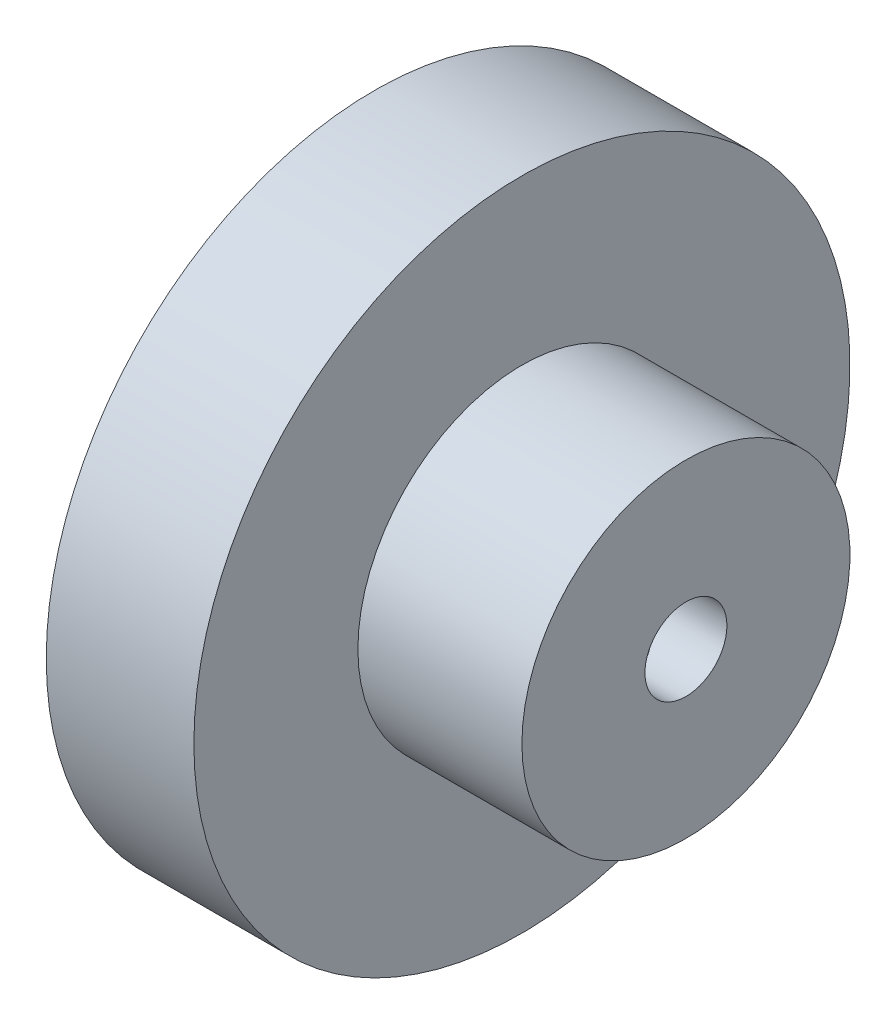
ISO-10303-21;
HEADER;
FILE_DESCRIPTION(('STEP AP214'),'2;1');
FILE_NAME('part.step','',(''),(''),'','','');
FILE_SCHEMA(('AUTOMOTIVE_DESIGN { 1 0 10303 214 1 1 1 1 }'));
ENDSEC;
DATA;
#1=APPLICATION_CONTEXT('core data for automotive mechanical design processes');
#2=APPLICATION_PROTOCOL_DEFINITION('international standard','automotive_design',2000,#1);
#3=PRODUCT_CONTEXT('',#1,'mechanical');
#4=PRODUCT('Part','Part','',(#3));
#5=PRODUCT_RELATED_PRODUCT_CATEGORY('part','',(#4));
#6=PRODUCT_DEFINITION_FORMATION('','',#4);
#7=PRODUCT_DEFINITION_CONTEXT('part definition',#1,'design');
#8=PRODUCT_DEFINITION('design','',#6,#7);
#9=PRODUCT_DEFINITION_SHAPE('','',#8);
#10=(LENGTH_UNIT() NAMED_UNIT(*) SI_UNIT(.MILLI.,.METRE.));
#11=(NAMED_UNIT(*) PLANE_ANGLE_UNIT() SI_UNIT($,.RADIAN.));
#12=(NAMED_UNIT(*) SI_UNIT($,.STERADIAN.) SOLID_ANGLE_UNIT());
#13=UNCERTAINTY_MEASURE_WITH_UNIT(LENGTH_MEASURE(1.E-05),#10,'distance_accuracy_value','');
#14=(GEOMETRIC_REPRESENTATION_CONTEXT(3) GLOBAL_UNCERTAINTY_ASSIGNED_CONTEXT((#13)) GLOBAL_UNIT_ASSIGNED_CONTEXT((#10,
#11,#12)) REPRESENTATION_CONTEXT('',''));
#15=CARTESIAN_POINT('',(0.,0.,0.));
#16=DIRECTION('',(0.,0.,1.));
#17=DIRECTION('',(1.,0.,0.));
#18=AXIS2_PLACEMENT_3D('',#15,#16,#17);
#19=CARTESIAN_POINT('',(0.,0.,-20.));
#20=DIRECTION('',(1.,0.,0.));
#21=DIRECTION('',(0.,0.,-1.));
#22=AXIS2_PLACEMENT_3D('',#19,#20,#21);
#23=PLANE('',#22);
#24=CARTESIAN_POINT('',(0.,0.,0.));
#25=DIRECTION('',(1.,0.,0.));
#26=DIRECTION('',(0.,0.,-1.));
#27=AXIS2_PLACEMENT_3D('',#24,#25,#26);
#28=CIRCLE('',#27,2.5);
#29=CARTESIAN_POINT('',(0.,0.,-2.5));
#30=VERTEX_POINT('',#29);
#31=EDGE_CURVE('E53',#30,#30,#28,.T.);
#32=ORIENTED_EDGE('',*,*,#31,.T.);
#33=EDGE_LOOP('',(#32));
#34=FACE_BOUND('',#33,.T.);
#35=CARTESIAN_POINT('',(0.,0.,0.));
#36=DIRECTION('',(-1.,0.,0.));
#37=DIRECTION('',(0.,0.,1.));
#38=AXIS2_PLACEMENT_3D('',#35,#36,#37);
#39=CIRCLE('',#38,20.);
#40=CARTESIAN_POINT('',(0.,0.,20.));
#41=VERTEX_POINT('',#40);
#42=EDGE_CURVE('E50',#41,#41,#39,.T.);
#43=ORIENTED_EDGE('',*,*,#42,.T.);
#44=EDGE_LOOP('',(#43));
#45=FACE_BOUND('',#44,.T.);
#46=ADVANCED_FACE('F30',(#34,#45),#23,.F.);
#47=CARTESIAN_POINT('',(19.,0.,0.));
#48=DIRECTION('',(-1.,0.,0.));
#49=DIRECTION('',(0.,0.,1.));
#50=AXIS2_PLACEMENT_3D('',#47,#48,#49);
#51=PLANE('',#50);
#52=CARTESIAN_POINT('',(19.,0.,0.));
#53=DIRECTION('',(1.,0.,0.));
#54=DIRECTION('',(0.,0.,-1.));
#55=AXIS2_PLACEMENT_3D('',#52,#53,#54);
#56=CIRCLE('',#55,2.5);
#57=CARTESIAN_POINT('',(19.,0.,-2.5));
#58=VERTEX_POINT('',#57);
#59=EDGE_CURVE('E56',#58,#58,#56,.T.);
#60=ORIENTED_EDGE('',*,*,#59,.F.);
#61=EDGE_LOOP('',(#60));
#62=FACE_BOUND('',#61,.T.);
#63=CARTESIAN_POINT('',(19.,0.,0.));
#64=DIRECTION('',(-1.,0.,0.));
#65=DIRECTION('',(0.,0.,1.));
#66=AXIS2_PLACEMENT_3D('',#63,#64,#65);
#67=CIRCLE('',#66,9.99999999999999);
#68=CARTESIAN_POINT('',(19.,0.,9.99999999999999));
#69=VERTEX_POINT('',#68);
#70=EDGE_CURVE('E10',#69,#69,#67,.T.);
#71=ORIENTED_EDGE('',*,*,#70,.F.);
#72=EDGE_LOOP('',(#71));
#73=FACE_BOUND('',#72,.T.);
#74=ADVANCED_FACE('F86',(#62,#73),#51,.F.);
#75=CARTESIAN_POINT('',(0.,0.,0.));
#76=DIRECTION('',(-1.,0.,0.));
#77=DIRECTION('',(0.,0.,1.));
#78=AXIS2_PLACEMENT_3D('',#75,#76,#77);
#79=CYLINDRICAL_SURFACE('',#78,9.99999999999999);
#80=CARTESIAN_POINT('',(12.,-10.,0.));
#81=CARTESIAN_POINT('',(12.0000040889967,-9.99999795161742,0.111153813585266));
#82=CARTESIAN_POINT('',(12.0092976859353,-9.99812770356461,0.222359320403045));
#83=CARTESIAN_POINT('',(12.0461970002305,-9.99084731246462,0.441627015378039));
#84=CARTESIAN_POINT('',(12.073817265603,-9.98543435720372,0.549686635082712));
#85=CARTESIAN_POINT('',(12.1464825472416,-9.97167298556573,0.759460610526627));
#86=CARTESIAN_POINT('',(12.1915108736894,-9.96332738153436,0.86118093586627));
#87=CARTESIAN_POINT('',(12.2976644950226,-9.94460796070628,1.05561597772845));
#88=CARTESIAN_POINT('',(12.3587888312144,-9.93423426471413,1.14833123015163));
#89=CARTESIAN_POINT('',(12.4962769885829,-9.91244330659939,1.32338695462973));
#90=CARTESIAN_POINT('',(12.5728167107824,-9.90101491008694,1.40558790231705));
#91=CARTESIAN_POINT('',(12.7385848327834,-9.87848360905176,1.55607351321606));
#92=CARTESIAN_POINT('',(12.8278142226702,-9.86738073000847,1.62435708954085));
#93=CARTESIAN_POINT('',(13.0174323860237,-9.8466488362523,1.74566350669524));
#94=CARTESIAN_POINT('',(13.1179152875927,-9.83703414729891,1.79854187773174));
#95=CARTESIAN_POINT('',(13.3265636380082,-9.82052536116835,1.88661133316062));
#96=CARTESIAN_POINT('',(13.4347283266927,-9.81363099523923,1.92180416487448));
#97=CARTESIAN_POINT('',(13.6541687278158,-9.80345610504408,1.97305059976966));
#98=CARTESIAN_POINT('',(13.7653850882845,-9.80012940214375,1.98934899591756));
#99=CARTESIAN_POINT('',(13.9890196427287,-9.79732750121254,2.00310425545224));
#100=CARTESIAN_POINT('',(14.1014377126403,-9.79785190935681,2.000563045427));
#101=CARTESIAN_POINT('',(14.322493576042,-9.80265102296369,1.97690914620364));
#102=CARTESIAN_POINT('',(14.4311628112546,-9.80686905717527,1.95607708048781));
#103=CARTESIAN_POINT('',(14.643432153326,-9.81849092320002,1.8968757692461));
#104=CARTESIAN_POINT('',(14.747032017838,-9.82589490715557,1.85850568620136));
#105=CARTESIAN_POINT('',(14.9470305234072,-9.84311237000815,1.76504956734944));
#106=CARTESIAN_POINT('',(15.0433757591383,-9.85294179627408,1.70985230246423));
#107=CARTESIAN_POINT('',(15.2255416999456,-9.87389237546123,1.58438714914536));
#108=CARTESIAN_POINT('',(15.3113611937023,-9.88501367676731,1.51411752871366));
#109=CARTESIAN_POINT('',(15.4716588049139,-9.90754042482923,1.35899986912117));
#110=CARTESIAN_POINT('',(15.5459051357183,-9.91894738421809,1.27391232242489));
#111=CARTESIAN_POINT('',(15.6791076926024,-9.94057697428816,1.09237004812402));
#112=CARTESIAN_POINT('',(15.7380637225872,-9.95079958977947,0.995915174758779));
#113=CARTESIAN_POINT('',(15.8390550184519,-9.96893380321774,0.794118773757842));
#114=CARTESIAN_POINT('',(15.8810637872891,-9.97684177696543,0.688763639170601));
#115=CARTESIAN_POINT('',(15.9467209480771,-9.98942817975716,0.47229795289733));
#116=CARTESIAN_POINT('',(15.9703715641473,-9.99410700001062,0.361188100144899));
#117=CARTESIAN_POINT('',(15.9983129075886,-9.99965343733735,0.138358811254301));
#118=CARTESIAN_POINT('',(16.0029208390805,-10.0005834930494,0.0266806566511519));
#119=CARTESIAN_POINT('',(15.9935002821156,-9.99870103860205,-0.195849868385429));
#120=CARTESIAN_POINT('',(15.9794728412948,-9.99588873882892,-0.306702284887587));
#121=CARTESIAN_POINT('',(15.9334432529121,-9.98687664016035,-0.523411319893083));
#122=CARTESIAN_POINT('',(15.9016038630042,-9.98070752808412,-0.629303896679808));
#123=CARTESIAN_POINT('',(15.8210320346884,-9.96567104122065,-0.834247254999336));
#124=CARTESIAN_POINT('',(15.7722983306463,-9.95680346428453,-0.93329752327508));
#125=CARTESIAN_POINT('',(15.6586350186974,-9.93719823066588,-1.12308234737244));
#126=CARTESIAN_POINT('',(15.5935144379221,-9.92643900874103,-1.21370025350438));
#127=CARTESIAN_POINT('',(15.4491816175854,-9.90429469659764,-1.38283603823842));
#128=CARTESIAN_POINT('',(15.3699678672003,-9.89290953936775,-1.46135261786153));
#129=CARTESIAN_POINT('',(15.1982532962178,-9.87058607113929,-1.60528118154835));
#130=CARTESIAN_POINT('',(15.1055685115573,-9.85965720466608,-1.67047540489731));
#131=CARTESIAN_POINT('',(14.9103772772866,-9.83968383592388,-1.78437084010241));
#132=CARTESIAN_POINT('',(14.8078712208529,-9.83063925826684,-1.83307271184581));
#133=CARTESIAN_POINT('',(14.5964635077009,-9.81553481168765,-1.91230368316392));
#134=CARTESIAN_POINT('',(14.4875983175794,-9.80945949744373,-1.9429269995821));
#135=CARTESIAN_POINT('',(14.2661330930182,-9.8009487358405,-1.9854173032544));
#136=CARTESIAN_POINT('',(14.1535335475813,-9.79851281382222,-1.99728673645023));
#137=CARTESIAN_POINT('',(13.9299822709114,-9.79758299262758,-2.00184182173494));
#138=CARTESIAN_POINT('',(13.819037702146,-9.79901838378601,-1.99487157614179));
#139=CARTESIAN_POINT('',(13.5999367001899,-9.80551146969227,-1.96270460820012));
#140=CARTESIAN_POINT('',(13.4917802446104,-9.81056913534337,-1.9375080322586));
#141=CARTESIAN_POINT('',(13.2815445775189,-9.82370528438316,-1.86975713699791));
#142=CARTESIAN_POINT('',(13.1794512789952,-9.8317764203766,-1.82724501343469));
#143=CARTESIAN_POINT('',(12.9837925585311,-9.8500342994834,-1.72610928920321));
#144=CARTESIAN_POINT('',(12.8902278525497,-9.86022121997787,-1.66748433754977));
#145=CARTESIAN_POINT('',(12.7125688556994,-9.8817792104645,-1.53461182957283));
#146=CARTESIAN_POINT('',(12.6286624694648,-9.89316745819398,-1.46011577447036));
#147=CARTESIAN_POINT('',(12.4744275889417,-9.91572163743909,-1.29812873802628));
#148=CARTESIAN_POINT('',(12.4041022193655,-9.92688751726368,-1.21063477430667));
#149=CARTESIAN_POINT('',(12.2783307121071,-9.94787664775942,-1.02403525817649));
#150=CARTESIAN_POINT('',(12.2230479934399,-9.95768462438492,-0.92481776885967));
#151=CARTESIAN_POINT('',(12.1300277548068,-9.97470250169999,-0.718332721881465));
#152=CARTESIAN_POINT('',(12.092274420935,-9.98191474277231,-0.611072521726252));
#153=CARTESIAN_POINT('',(12.0426961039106,-9.99152745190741,-0.419642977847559));
#154=CARTESIAN_POINT('',(12.0267136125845,-9.99468606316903,-0.336563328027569));
#155=CARTESIAN_POINT('',(12.0053641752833,-9.99892308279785,-0.168999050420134));
#156=CARTESIAN_POINT('',(11.9999968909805,-10.0000015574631,-0.0845144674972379));
#157=CARTESIAN_POINT('',(12.,-10.,0.));
#158=B_SPLINE_CURVE_WITH_KNOTS('',3,(#80,#81,#82,#83,#84,#85,#86,#87,#88,#89,#90,#91,#92,#93,
#94,#95,#96,#97,#98,#99,#100,#101,#102,#103,#104,#105,#106,#107,#108,#109,#110,#111,#112,#113,
#114,#115,#116,#117,#118,#119,#120,#121,#122,#123,#124,#125,#126,#127,#128,#129,#130,#131,#132,
#133,#134,#135,#136,#137,#138,#139,#140,#141,#142,#143,#144,#145,#146,#147,#148,#149,#150,#151,
#152,#153,#154,#155,#156,#157),.UNSPECIFIED.,.T.,.F.,(4,2,2,2,2,2,2,2,2,2,2,2,2,2,2,2,2,2,2,2,2,
2,2,2,2,2,2,2,2,2,2,2,2,2,2,2,2,2,4),(0.,0.333152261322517,0.666569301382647,0.999667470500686,
1.33274580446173,1.66986534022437,2.00701119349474,2.34722390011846,2.68740298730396,
3.02312370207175,3.35881008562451,3.68943454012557,4.0200747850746,4.35294980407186,
4.68586309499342,5.02476504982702,5.36367135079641,5.70310549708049,6.04249851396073,
6.37621471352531,6.70991215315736,7.04060907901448,7.37133078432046,7.70610132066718,
8.04090776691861,8.38081257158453,8.72070377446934,9.05880762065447,9.39686736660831,
9.72879445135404,10.0607188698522,10.3918392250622,10.7229873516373,11.0597615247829,
11.3966130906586,11.7369899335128,12.0770591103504,12.3303755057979,12.5836838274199),.UNSPECIFIED.);
#159=CARTESIAN_POINT('',(12.,-10.,0.));
#160=VERTEX_POINT('',#159);
#161=EDGE_CURVE('E59',#160,#160,#158,.T.);
#162=ORIENTED_EDGE('',*,*,#161,.T.);
#163=EDGE_LOOP('',(#162));
#164=FACE_BOUND('',#163,.T.);
#165=CARTESIAN_POINT('',(9.,0.,0.));
#166=DIRECTION('',(-1.,0.,0.));
#167=DIRECTION('',(0.,0.,1.));
#168=AXIS2_PLACEMENT_3D('',#165,#166,#167);
#169=CIRCLE('',#168,9.99999999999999);
#170=CARTESIAN_POINT('',(9.,0.,9.99999999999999));
#171=VERTEX_POINT('',#170);
#172=EDGE_CURVE('E41',#171,#171,#169,.T.);
#173=ORIENTED_EDGE('',*,*,#172,.F.);
#174=EDGE_LOOP('',(#173));
#175=FACE_BOUND('',#174,.T.);
#176=ORIENTED_EDGE('',*,*,#70,.T.);
#177=EDGE_LOOP('',(#176));
#178=FACE_BOUND('',#177,.T.);
#179=ADVANCED_FACE('F64',(#164,#175,#178),#79,.T.);
#180=CARTESIAN_POINT('',(9.,0.,-9.99999999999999));
#181=DIRECTION('',(-1.,0.,0.));
#182=DIRECTION('',(0.,0.,1.));
#183=AXIS2_PLACEMENT_3D('',#180,#181,#182);
#184=PLANE('',#183);
#185=CARTESIAN_POINT('',(8.99999999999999,0.,0.));
#186=DIRECTION('',(-1.,0.,0.));
#187=DIRECTION('',(0.,0.,1.));
#188=AXIS2_PLACEMENT_3D('',#185,#186,#187);
#189=CIRCLE('',#188,20.);
#190=CARTESIAN_POINT('',(8.99999999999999,0.,20.));
#191=VERTEX_POINT('',#190);
#192=EDGE_CURVE('E45',#191,#191,#189,.T.);
#193=ORIENTED_EDGE('',*,*,#192,.F.);
#194=EDGE_LOOP('',(#193));
#195=FACE_BOUND('',#194,.T.);
#196=ORIENTED_EDGE('',*,*,#172,.T.);
#197=EDGE_LOOP('',(#196));
#198=FACE_BOUND('',#197,.T.);
#199=ADVANCED_FACE('F79',(#195,#198),#184,.F.);
#200=CARTESIAN_POINT('',(0.,0.,0.));
#201=DIRECTION('',(-1.,0.,0.));
#202=DIRECTION('',(0.,0.,1.));
#203=AXIS2_PLACEMENT_3D('',#200,#201,#202);
#204=CYLINDRICAL_SURFACE('',#203,20.);
#205=ORIENTED_EDGE('',*,*,#42,.F.);
#206=EDGE_LOOP('',(#205));
#207=FACE_BOUND('',#206,.T.);
#208=ORIENTED_EDGE('',*,*,#192,.T.);
#209=EDGE_LOOP('',(#208));
#210=FACE_BOUND('',#209,.T.);
#211=ADVANCED_FACE('F76',(#207,#210),#204,.T.);
#212=CARTESIAN_POINT('',(0.,0.,0.));
#213=DIRECTION('',(1.,0.,0.));
#214=DIRECTION('',(0.,0.,-1.));
#215=AXIS2_PLACEMENT_3D('',#212,#213,#214);
#216=CYLINDRICAL_SURFACE('',#215,2.5);
#217=CARTESIAN_POINT('',(14.,-1.5,2.));
#218=CARTESIAN_POINT('',(13.9249189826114,-1.5000227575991,1.9999899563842));
#219=CARTESIAN_POINT('',(13.8497210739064,-1.50575588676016,1.99572243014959));
#220=CARTESIAN_POINT('',(13.7016854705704,-1.52759797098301,1.97904350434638));
#221=CARTESIAN_POINT('',(13.6288567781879,-1.54374252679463,1.96660415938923));
#222=CARTESIAN_POINT('',(13.4623945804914,-1.59078313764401,1.9288828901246));
#223=CARTESIAN_POINT('',(13.3703574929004,-1.62485949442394,1.90063587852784));
#224=CARTESIAN_POINT('',(13.1940318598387,-1.70094533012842,1.83286412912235));
#225=CARTESIAN_POINT('',(13.1097660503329,-1.74297705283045,1.79330760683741));
#226=CARTESIAN_POINT('',(12.9196603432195,-1.84624966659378,1.68777756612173));
#227=CARTESIAN_POINT('',(12.8170334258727,-1.90894188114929,1.61742363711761));
#228=CARTESIAN_POINT('',(12.6260231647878,-2.03287996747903,1.4586193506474));
#229=CARTESIAN_POINT('',(12.5376280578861,-2.0941269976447,1.37018407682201));
#230=CARTESIAN_POINT('',(12.3928950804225,-2.1979067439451,1.19476026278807));
#231=CARTESIAN_POINT('',(12.3336737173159,-2.24174680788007,1.11093376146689));
#232=CARTESIAN_POINT('',(12.2276340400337,-2.32165152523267,0.932444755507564));
#233=CARTESIAN_POINT('',(12.1807964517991,-2.35772824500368,0.837799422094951));
#234=CARTESIAN_POINT('',(12.1082870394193,-2.41415644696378,0.655317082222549));
#235=CARTESIAN_POINT('',(12.0804174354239,-2.43610736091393,0.568853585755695));
#236=CARTESIAN_POINT('',(12.036501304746,-2.47085912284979,0.391188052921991));
#237=CARTESIAN_POINT('',(12.0204483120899,-2.48366497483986,0.299988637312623));
#238=CARTESIAN_POINT('',(12.0011419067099,-2.49907968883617,0.115048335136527));
#239=CARTESIAN_POINT('',(11.9979328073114,-2.50165324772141,0.0212997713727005));
#240=CARTESIAN_POINT('',(12.0046642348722,-2.49626936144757,-0.165416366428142));
#241=CARTESIAN_POINT('',(12.0146053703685,-2.48831142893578,-0.258383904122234));
#242=CARTESIAN_POINT('',(12.046067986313,-2.4632836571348,-0.435683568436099));
#243=CARTESIAN_POINT('',(12.0669288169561,-2.44673404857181,-0.5202101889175));
#244=CARTESIAN_POINT('',(12.1186952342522,-2.40604493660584,-0.684171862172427));
#245=CARTESIAN_POINT('',(12.1496033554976,-2.38190351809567,-0.763605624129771));
#246=CARTESIAN_POINT('',(12.2236006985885,-2.32486221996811,-0.923527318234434));
#247=CARTESIAN_POINT('',(12.2675765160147,-2.29134265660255,-1.00337969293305));
#248=CARTESIAN_POINT('',(12.3645378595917,-2.21894043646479,-1.15470891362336));
#249=CARTESIAN_POINT('',(12.4175284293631,-2.18005477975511,-1.22618103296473));
#250=CARTESIAN_POINT('',(12.5430618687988,-2.09053510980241,-1.37426521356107));
#251=CARTESIAN_POINT('',(12.6173836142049,-2.03913144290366,-1.44890108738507));
#252=CARTESIAN_POINT('',(12.7762559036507,-1.9349237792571,-1.58538384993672));
#253=CARTESIAN_POINT('',(12.8608188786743,-1.88211814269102,-1.64721494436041));
#254=CARTESIAN_POINT('',(13.0312201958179,-1.78441317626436,-1.75228528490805));
#255=CARTESIAN_POINT('',(13.1161509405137,-1.73924224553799,-1.79674173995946));
#256=CARTESIAN_POINT('',(13.2943664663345,-1.65582105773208,-1.87389106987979));
#257=CARTESIAN_POINT('',(13.3876324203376,-1.61755576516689,-1.90660965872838));
#258=CARTESIAN_POINT('',(13.5527916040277,-1.56393805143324,-1.95062199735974));
#259=CARTESIAN_POINT('',(13.6226128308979,-1.54515601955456,-1.96540293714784));
#260=CARTESIAN_POINT('',(13.7651802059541,-1.51667304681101,-1.98746978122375));
#261=CARTESIAN_POINT('',(13.8379194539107,-1.50695186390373,-1.99477239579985));
#262=CARTESIAN_POINT('',(13.9848633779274,-1.49827790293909,-2.0012999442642));
#263=CARTESIAN_POINT('',(14.0590740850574,-1.49938753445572,-2.00047806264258));
#264=CARTESIAN_POINT('',(14.2060473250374,-1.51230456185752,-1.99072610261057));
#265=CARTESIAN_POINT('',(14.2788076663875,-1.52412705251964,-1.98178458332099));
#266=CARTESIAN_POINT('',(14.4390632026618,-1.56051508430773,-1.95331430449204));
#267=CARTESIAN_POINT('',(14.5255982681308,-1.58755721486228,-1.9316709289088));
#268=CARTESIAN_POINT('',(14.6922908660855,-1.65022809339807,-1.87841388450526));
#269=CARTESIAN_POINT('',(14.7724284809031,-1.68588236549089,-1.84677049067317));
#270=CARTESIAN_POINT('',(14.9615289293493,-1.77903249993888,-1.75807608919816));
#271=CARTESIAN_POINT('',(15.0668953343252,-1.83905564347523,-1.69602510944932));
#272=CARTESIAN_POINT('',(15.264384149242,-1.96026853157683,-1.55438039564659));
#273=CARTESIAN_POINT('',(15.3564907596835,-2.02145957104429,-1.47476601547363));
#274=CARTESIAN_POINT('',(15.527462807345,-2.13993299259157,-1.29702304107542));
#275=CARTESIAN_POINT('',(15.6061226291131,-2.1971478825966,-1.19864860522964));
#276=CARTESIAN_POINT('',(15.7452665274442,-2.30083046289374,-0.984970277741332));
#277=CARTESIAN_POINT('',(15.8058096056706,-2.3473329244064,-0.869723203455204));
#278=CARTESIAN_POINT('',(15.8884905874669,-2.41163161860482,-0.664531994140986));
#279=CARTESIAN_POINT('',(15.9167173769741,-2.43384921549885,-0.578408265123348));
#280=CARTESIAN_POINT('',(15.961432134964,-2.46921550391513,-0.401365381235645));
#281=CARTESIAN_POINT('',(15.9779290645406,-2.48237111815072,-0.310449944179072));
#282=CARTESIAN_POINT('',(15.9981928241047,-2.49854699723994,-0.125961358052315));
#283=CARTESIAN_POINT('',(16.0019132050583,-2.50153028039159,-0.0323797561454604));
#284=CARTESIAN_POINT('',(15.9962334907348,-2.4969871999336,0.154129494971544));
#285=CARTESIAN_POINT('',(15.9868324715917,-2.48946009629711,0.24705709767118));
#286=CARTESIAN_POINT('',(15.9563964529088,-2.46524008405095,0.424484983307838));
#287=CARTESIAN_POINT('',(15.9360106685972,-2.44905900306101,0.509170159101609));
#288=CARTESIAN_POINT('',(15.8851465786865,-2.4090520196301,0.67352054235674));
#289=CARTESIAN_POINT('',(15.854665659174,-2.3852241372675,0.753184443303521));
#290=CARTESIAN_POINT('',(15.7816254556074,-2.32886203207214,0.913383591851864));
#291=CARTESIAN_POINT('',(15.738206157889,-2.29572397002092,0.993310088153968));
#292=CARTESIAN_POINT('',(15.6423576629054,-2.22403396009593,1.14486396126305));
#293=CARTESIAN_POINT('',(15.5899236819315,-2.18547913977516,1.21648689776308));
#294=CARTESIAN_POINT('',(15.4657037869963,-2.0966685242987,1.36488223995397));
#295=CARTESIAN_POINT('',(15.3921535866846,-2.04563299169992,1.4397080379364));
#296=CARTESIAN_POINT('',(15.2348830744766,-1.9420131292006,1.5766935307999));
#297=CARTESIAN_POINT('',(15.1511501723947,-1.88942694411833,1.63883728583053));
#298=CARTESIAN_POINT('',(14.9810424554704,-1.79109125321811,1.7455126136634));
#299=CARTESIAN_POINT('',(14.8954274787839,-1.74513263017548,1.79106140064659));
#300=CARTESIAN_POINT('',(14.7156081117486,-1.66007449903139,1.87016304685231));
#301=CARTESIAN_POINT('',(14.6214202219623,-1.6209622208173,1.90373836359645));
#302=CARTESIAN_POINT('',(14.4538606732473,-1.56580101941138,1.94914139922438));
#303=CARTESIAN_POINT('',(14.3825804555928,-1.54635220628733,1.96446470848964));
#304=CARTESIAN_POINT('',(14.2369757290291,-1.51695472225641,1.98726282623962));
#305=CARTESIAN_POINT('',(14.1626639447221,-1.50696990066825,1.99476751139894));
#306=CARTESIAN_POINT('',(14.0586747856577,-1.50085460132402,1.99935742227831));
#307=CARTESIAN_POINT('',(14.0293463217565,-1.49999110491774,2.00000392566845));
#308=CARTESIAN_POINT('',(14.,-1.5,2.));
#309=B_SPLINE_CURVE_WITH_KNOTS('',3,(#217,#218,#219,#220,#221,#222,#223,#224,#225,#226,#227,
#228,#229,#230,#231,#232,#233,#234,#235,#236,#237,#238,#239,#240,#241,#242,#243,#244,#245,#246,
#247,#248,#249,#250,#251,#252,#253,#254,#255,#256,#257,#258,#259,#260,#261,#262,#263,#264,#265,
#266,#267,#268,#269,#270,#271,#272,#273,#274,#275,#276,#277,#278,#279,#280,#281,#282,#283,#284,
#285,#286,#287,#288,#289,#290,#291,#292,#293,#294,#295,#296,#297,#298,#299,#300,#301,#302,#303,
#304,#305,#306,#307,#308),.UNSPECIFIED.,.T.,.F.,(4,2,2,2,2,2,2,2,2,2,2,2,2,2,2,2,2,2,2,2,2,2,2,
2,2,2,2,2,2,2,2,2,2,2,2,2,2,2,2,2,2,2,2,2,2,4),(0.,0.225140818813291,0.451055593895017,
0.75571438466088,1.06123795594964,1.47720804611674,1.8928325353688,2.22639303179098,
2.55943127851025,2.83862094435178,3.1176577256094,3.39765639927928,3.67766803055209,
3.94241917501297,4.20723715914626,4.49756510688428,4.78805602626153,5.13841226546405,
5.48919811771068,5.80619193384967,6.12248701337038,6.34307726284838,6.56317352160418,
6.78453876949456,7.00621641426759,7.28428560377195,7.56318925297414,7.96975811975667,
8.37680748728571,8.78961174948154,9.20105660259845,9.47985927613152,9.75844872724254,
10.0380499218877,10.3176708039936,10.5823344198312,10.8470666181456,11.1364335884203,
11.4259545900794,11.7747351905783,12.1239515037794,12.4449574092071,12.7653580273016,
12.9909138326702,13.2156045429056,13.3036035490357),.UNSPECIFIED.);
#310=CARTESIAN_POINT('',(14.,-1.5,2.));
#311=VERTEX_POINT('',#310);
#312=EDGE_CURVE('E33',#311,#311,#309,.T.);
#313=ORIENTED_EDGE('',*,*,#312,.T.);
#314=EDGE_LOOP('',(#313));
#315=FACE_BOUND('',#314,.T.);
#316=ORIENTED_EDGE('',*,*,#31,.F.);
#317=EDGE_LOOP('',(#316));
#318=FACE_BOUND('',#317,.T.);
#319=ORIENTED_EDGE('',*,*,#59,.T.);
#320=EDGE_LOOP('',(#319));
#321=FACE_BOUND('',#320,.T.);
#322=ADVANCED_FACE('F70',(#315,#318,#321),#216,.F.);
#323=CARTESIAN_POINT('',(14.,-10.,0.));
#324=DIRECTION('',(0.,1.,0.));
#325=DIRECTION('',(0.,0.,1.));
#326=AXIS2_PLACEMENT_3D('',#323,#324,#325);
#327=CYLINDRICAL_SURFACE('',#326,2.);
#328=ORIENTED_EDGE('',*,*,#312,.F.);
#329=EDGE_LOOP('',(#328));
#330=FACE_BOUND('',#329,.T.);
#331=ORIENTED_EDGE('',*,*,#161,.F.);
#332=EDGE_LOOP('',(#331));
#333=FACE_BOUND('',#332,.T.);
#334=ADVANCED_FACE('F67',(#330,#333),#327,.F.);
#335=CLOSED_SHELL('',(#46,#74,#179,#199,#211,#322,#334));
#336=MANIFOLD_SOLID_BREP('B2',#335);
#337=ADVANCED_BREP_SHAPE_REPRESENTATION('',(#18,#336),#14);
#338=SHAPE_DEFINITION_REPRESENTATION(#9,#337);
ENDSEC;
END-ISO-10303-21;
